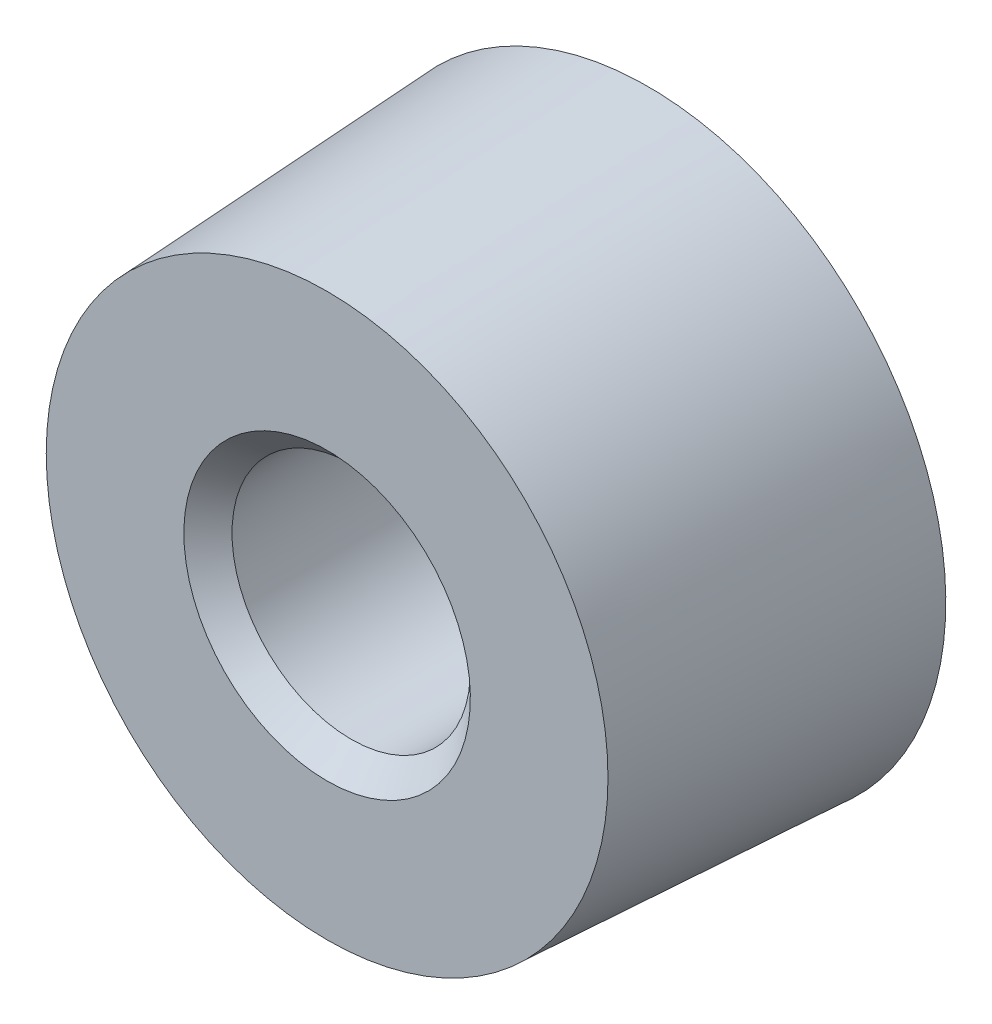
ISO-10303-21;
HEADER;
FILE_DESCRIPTION(('STEP AP214'),'2;1');
FILE_NAME('part.step','',(''),(''),'','','');
FILE_SCHEMA(('AUTOMOTIVE_DESIGN { 1 0 10303 214 1 1 1 1 }'));
ENDSEC;
DATA;
#1=APPLICATION_CONTEXT('core data for automotive mechanical design processes');
#2=APPLICATION_PROTOCOL_DEFINITION('international standard','automotive_design',2000,#1);
#3=PRODUCT_CONTEXT('',#1,'mechanical');
#4=PRODUCT('Part','Part','',(#3));
#5=PRODUCT_RELATED_PRODUCT_CATEGORY('part','',(#4));
#6=PRODUCT_DEFINITION_FORMATION('','',#4);
#7=PRODUCT_DEFINITION_CONTEXT('part definition',#1,'design');
#8=PRODUCT_DEFINITION('design','',#6,#7);
#9=PRODUCT_DEFINITION_SHAPE('','',#8);
#10=(LENGTH_UNIT() NAMED_UNIT(*) SI_UNIT(.MILLI.,.METRE.));
#11=(NAMED_UNIT(*) PLANE_ANGLE_UNIT() SI_UNIT($,.RADIAN.));
#12=(NAMED_UNIT(*) SI_UNIT($,.STERADIAN.) SOLID_ANGLE_UNIT());
#13=UNCERTAINTY_MEASURE_WITH_UNIT(LENGTH_MEASURE(1.E-05),#10,'distance_accuracy_value','');
#14=(GEOMETRIC_REPRESENTATION_CONTEXT(3) GLOBAL_UNCERTAINTY_ASSIGNED_CONTEXT((#13)) GLOBAL_UNIT_ASSIGNED_CONTEXT((#10,
#11,#12)) REPRESENTATION_CONTEXT('',''));
#15=CARTESIAN_POINT('',(0.,0.,0.));
#16=DIRECTION('',(0.,0.,1.));
#17=DIRECTION('',(1.,0.,0.));
#18=AXIS2_PLACEMENT_3D('',#15,#16,#17);
#19=CARTESIAN_POINT('',(65.3280149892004,-35.1722352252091,0.));
#20=DIRECTION('',(0.,0.,-1.));
#21=DIRECTION('',(0.,-1.,0.));
#22=AXIS2_PLACEMENT_3D('',#19,#20,#21);
#23=PLANE('',#22);
#24=CARTESIAN_POINT('',(65.3280149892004,-35.1722352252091,0.));
#25=DIRECTION('',(0.,0.,-1.));
#26=DIRECTION('',(0.,-1.,0.));
#27=AXIS2_PLACEMENT_3D('',#24,#25,#26);
#28=CIRCLE('',#27,1.793925);
#29=CARTESIAN_POINT('',(65.3280149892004,-36.9661602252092,0.));
#30=VERTEX_POINT('',#29);
#31=EDGE_CURVE('E22',#30,#30,#28,.F.);
#32=ORIENTED_EDGE('',*,*,#31,.T.);
#33=EDGE_LOOP('',(#32));
#34=FACE_BOUND('',#33,.T.);
#35=CARTESIAN_POINT('',(65.3280149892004,-35.1722352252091,0.));
#36=DIRECTION('',(0.,0.,-1.));
#37=DIRECTION('',(0.,-1.,0.));
#38=AXIS2_PLACEMENT_3D('',#35,#36,#37);
#39=CIRCLE('',#38,3.72817927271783);
#40=CARTESIAN_POINT('',(65.3280149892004,-38.900414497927,0.));
#41=VERTEX_POINT('',#40);
#42=EDGE_CURVE('E53',#41,#41,#39,.T.);
#43=ORIENTED_EDGE('',*,*,#42,.T.);
#44=EDGE_LOOP('',(#43));
#45=FACE_BOUND('',#44,.T.);
#46=ADVANCED_FACE('F14',(#34,#45),#23,.T.);
#47=CARTESIAN_POINT('',(65.3280149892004,-35.1722352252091,4.02000000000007));
#48=DIRECTION('',(0.,0.,-1.));
#49=DIRECTION('',(0.,-1.,0.));
#50=AXIS2_PLACEMENT_3D('',#47,#48,#49);
#51=PLANE('',#50);
#52=CARTESIAN_POINT('',(65.3280149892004,-35.1722352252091,4.02000000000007));
#53=DIRECTION('',(0.,0.,-1.));
#54=DIRECTION('',(0.,-1.,0.));
#55=AXIS2_PLACEMENT_3D('',#52,#53,#54);
#56=CIRCLE('',#55,1.793925);
#57=CARTESIAN_POINT('',(65.3280149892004,-36.9661602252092,4.02000000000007));
#58=VERTEX_POINT('',#57);
#59=EDGE_CURVE('E10',#58,#58,#56,.T.);
#60=ORIENTED_EDGE('',*,*,#59,.T.);
#61=EDGE_LOOP('',(#60));
#62=FACE_BOUND('',#61,.T.);
#63=CARTESIAN_POINT('',(65.3280149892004,-35.1722352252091,4.02000000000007));
#64=DIRECTION('',(0.,0.,-1.));
#65=DIRECTION('',(0.,-1.,0.));
#66=AXIS2_PLACEMENT_3D('',#63,#64,#65);
#67=CIRCLE('',#66,3.5175);
#68=CARTESIAN_POINT('',(65.3280149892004,-38.6897352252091,4.02000000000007));
#69=VERTEX_POINT('',#68);
#70=EDGE_CURVE('E56',#69,#69,#67,.T.);
#71=ORIENTED_EDGE('',*,*,#70,.F.);
#72=EDGE_LOOP('',(#71));
#73=FACE_BOUND('',#72,.T.);
#74=ADVANCED_FACE('F67',(#62,#73),#51,.F.);
#75=CARTESIAN_POINT('',(65.3280149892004,-35.1722352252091,4.02000000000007));
#76=DIRECTION('',(0.,0.,-1.));
#77=DIRECTION('',(0.,-1.,0.));
#78=AXIS2_PLACEMENT_3D('',#75,#76,#77);
#79=CONICAL_SURFACE('',#78,3.5175,0.05235987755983);
#80=ORIENTED_EDGE('',*,*,#42,.F.);
#81=EDGE_LOOP('',(#80));
#82=FACE_BOUND('',#81,.T.);
#83=ORIENTED_EDGE('',*,*,#70,.T.);
#84=EDGE_LOOP('',(#83));
#85=FACE_BOUND('',#84,.T.);
#86=ADVANCED_FACE('F16',(#82,#85),#79,.T.);
#87=CARTESIAN_POINT('',(65.3280149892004,-35.1722352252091,0.));
#88=DIRECTION('',(0.,0.,1.));
#89=DIRECTION('',(0.,1.,0.));
#90=AXIS2_PLACEMENT_3D('',#87,#88,#89);
#91=CYLINDRICAL_SURFACE('',#90,1.492425);
#92=CARTESIAN_POINT('',(65.3280149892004,-35.1722352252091,0.301500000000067));
#93=DIRECTION('',(0.,0.,-1.));
#94=DIRECTION('',(0.,-1.,0.));
#95=AXIS2_PLACEMENT_3D('',#92,#93,#94);
#96=CIRCLE('',#95,1.492425);
#97=CARTESIAN_POINT('',(65.3280149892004,-36.6646602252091,0.301500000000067));
#98=VERTEX_POINT('',#97);
#99=EDGE_CURVE('E36',#98,#98,#96,.T.);
#100=ORIENTED_EDGE('',*,*,#99,.T.);
#101=EDGE_LOOP('',(#100));
#102=FACE_BOUND('',#101,.T.);
#103=CARTESIAN_POINT('',(65.3280149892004,-35.1722352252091,3.71850000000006));
#104=DIRECTION('',(0.,0.,-1.));
#105=DIRECTION('',(0.,-1.,0.));
#106=AXIS2_PLACEMENT_3D('',#103,#104,#105);
#107=CIRCLE('',#106,1.492425);
#108=CARTESIAN_POINT('',(65.3280149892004,-36.6646602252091,3.71850000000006));
#109=VERTEX_POINT('',#108);
#110=EDGE_CURVE('E47',#109,#109,#107,.F.);
#111=ORIENTED_EDGE('',*,*,#110,.T.);
#112=EDGE_LOOP('',(#111));
#113=FACE_BOUND('',#112,.T.);
#114=ADVANCED_FACE('F75',(#102,#113),#91,.F.);
#115=CARTESIAN_POINT('',(65.3280149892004,-35.1722352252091,0.301500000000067));
#116=DIRECTION('',(0.,0.,-1.));
#117=DIRECTION('',(0.,-1.,0.));
#118=AXIS2_PLACEMENT_3D('',#115,#116,#117);
#119=CONICAL_SURFACE('',#118,1.492425,0.785398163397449);
#120=ORIENTED_EDGE('',*,*,#31,.F.);
#121=EDGE_LOOP('',(#120));
#122=FACE_BOUND('',#121,.T.);
#123=ORIENTED_EDGE('',*,*,#99,.F.);
#124=EDGE_LOOP('',(#123));
#125=FACE_BOUND('',#124,.T.);
#126=ADVANCED_FACE('F80',(#122,#125),#119,.F.);
#127=CARTESIAN_POINT('',(65.3280149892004,-35.1722352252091,4.02000000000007));
#128=DIRECTION('',(0.,0.,1.));
#129=DIRECTION('',(0.,1.,0.));
#130=AXIS2_PLACEMENT_3D('',#127,#128,#129);
#131=CONICAL_SURFACE('',#130,1.793925,0.785398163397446);
#132=ORIENTED_EDGE('',*,*,#110,.F.);
#133=EDGE_LOOP('',(#132));
#134=FACE_BOUND('',#133,.T.);
#135=ORIENTED_EDGE('',*,*,#59,.F.);
#136=EDGE_LOOP('',(#135));
#137=FACE_BOUND('',#136,.T.);
#138=ADVANCED_FACE('F84',(#134,#137),#131,.F.);
#139=CLOSED_SHELL('',(#46,#74,#86,#114,#126,#138));
#140=MANIFOLD_SOLID_BREP('B1',#139);
#141=ADVANCED_BREP_SHAPE_REPRESENTATION('',(#18,#140),#14);
#142=SHAPE_DEFINITION_REPRESENTATION(#9,#141);
ENDSEC;
END-ISO-10303-21;
